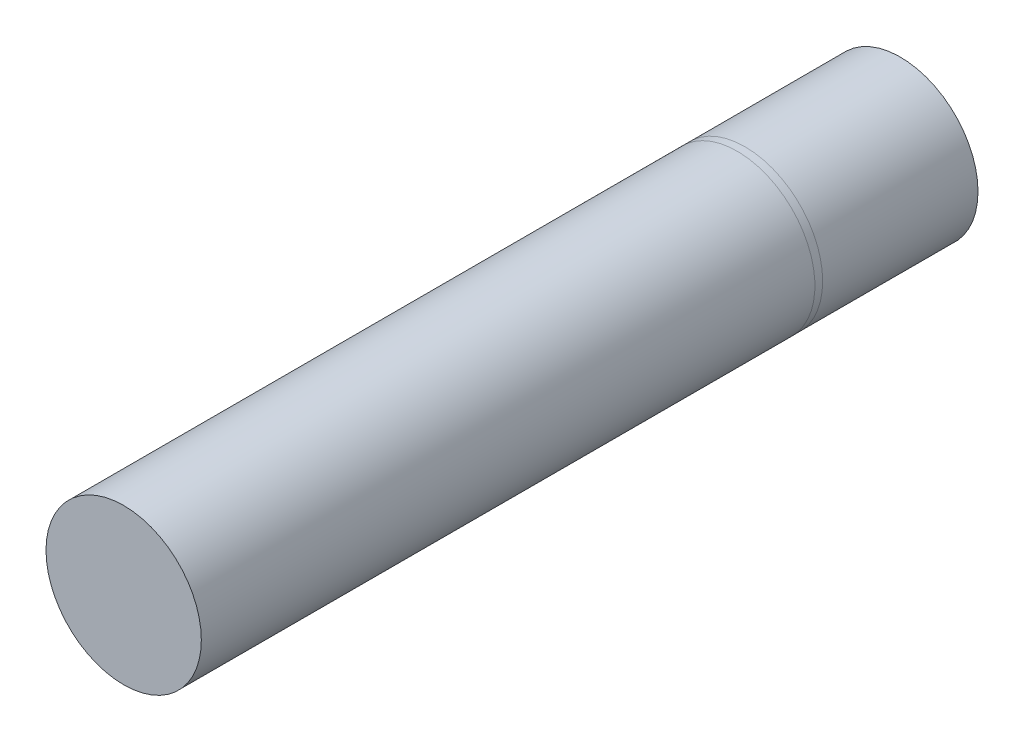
ISO-10303-21;
HEADER;
FILE_DESCRIPTION(('STEP AP214'),'2;1');
FILE_NAME('part.step','',(''),(''),'','','');
FILE_SCHEMA(('AUTOMOTIVE_DESIGN { 1 0 10303 214 1 1 1 1 }'));
ENDSEC;
DATA;
#1=APPLICATION_CONTEXT('core data for automotive mechanical design processes');
#2=APPLICATION_PROTOCOL_DEFINITION('international standard','automotive_design',2000,#1);
#3=PRODUCT_CONTEXT('',#1,'mechanical');
#4=PRODUCT('Part','Part','',(#3));
#5=PRODUCT_RELATED_PRODUCT_CATEGORY('part','',(#4));
#6=PRODUCT_DEFINITION_FORMATION('','',#4);
#7=PRODUCT_DEFINITION_CONTEXT('part definition',#1,'design');
#8=PRODUCT_DEFINITION('design','',#6,#7);
#9=PRODUCT_DEFINITION_SHAPE('','',#8);
#10=(LENGTH_UNIT() NAMED_UNIT(*) SI_UNIT(.MILLI.,.METRE.));
#11=(NAMED_UNIT(*) PLANE_ANGLE_UNIT() SI_UNIT($,.RADIAN.));
#12=(NAMED_UNIT(*) SI_UNIT($,.STERADIAN.) SOLID_ANGLE_UNIT());
#13=UNCERTAINTY_MEASURE_WITH_UNIT(LENGTH_MEASURE(1.E-05),#10,'distance_accuracy_value','');
#14=(GEOMETRIC_REPRESENTATION_CONTEXT(3) GLOBAL_UNCERTAINTY_ASSIGNED_CONTEXT((#13)) GLOBAL_UNIT_ASSIGNED_CONTEXT((#10,
#11,#12)) REPRESENTATION_CONTEXT('',''));
#15=CARTESIAN_POINT('',(0.,0.,0.));
#16=DIRECTION('',(0.,0.,1.));
#17=DIRECTION('',(1.,0.,0.));
#18=AXIS2_PLACEMENT_3D('',#15,#16,#17);
#19=CARTESIAN_POINT('',(0.,0.,100.));
#20=DIRECTION('',(0.,0.,-1.));
#21=DIRECTION('',(-1.,0.,0.));
#22=AXIS2_PLACEMENT_3D('',#19,#20,#21);
#23=CYLINDRICAL_SURFACE('',#22,10.);
#24=CARTESIAN_POINT('',(0.,0.,100.));
#25=DIRECTION('',(0.,0.,1.));
#26=DIRECTION('',(1.,0.,0.));
#27=AXIS2_PLACEMENT_3D('',#24,#25,#26);
#28=CIRCLE('',#27,10.);
#29=CARTESIAN_POINT('',(10.,0.,100.));
#30=VERTEX_POINT('',#29);
#31=EDGE_CURVE('E49',#30,#30,#28,.T.);
#32=ORIENTED_EDGE('',*,*,#31,.F.);
#33=EDGE_LOOP('',(#32));
#34=FACE_BOUND('',#33,.T.);
#35=CARTESIAN_POINT('',(0.,0.,21.));
#36=DIRECTION('',(0.,0.,-1.));
#37=DIRECTION('',(-1.,0.,0.));
#38=AXIS2_PLACEMENT_3D('',#35,#36,#37);
#39=CIRCLE('',#38,10.);
#40=CARTESIAN_POINT('',(-10.,0.,21.));
#41=VERTEX_POINT('',#40);
#42=EDGE_CURVE('E10',#41,#41,#39,.T.);
#43=ORIENTED_EDGE('',*,*,#42,.F.);
#44=EDGE_LOOP('',(#43));
#45=FACE_BOUND('',#44,.T.);
#46=ADVANCED_FACE('F34',(#34,#45),#23,.T.);
#47=CARTESIAN_POINT('',(0.,0.,0.));
#48=DIRECTION('',(0.,0.,1.));
#49=DIRECTION('',(1.,0.,0.));
#50=AXIS2_PLACEMENT_3D('',#47,#48,#49);
#51=CIRCLE('',#50,10.);
#52=CARTESIAN_POINT('',(10.,0.,0.));
#53=VERTEX_POINT('',#52);
#54=EDGE_CURVE('E55',#53,#53,#51,.T.);
#55=ORIENTED_EDGE('',*,*,#54,.T.);
#56=EDGE_LOOP('',(#55));
#57=FACE_BOUND('',#56,.T.);
#58=CARTESIAN_POINT('',(0.,0.,20.));
#59=DIRECTION('',(0.,0.,1.));
#60=DIRECTION('',(1.,0.,0.));
#61=AXIS2_PLACEMENT_3D('',#58,#59,#60);
#62=CIRCLE('',#61,10.);
#63=CARTESIAN_POINT('',(10.,0.,20.));
#64=VERTEX_POINT('',#63);
#65=EDGE_CURVE('E42',#64,#64,#62,.T.);
#66=ORIENTED_EDGE('',*,*,#65,.F.);
#67=EDGE_LOOP('',(#66));
#68=FACE_BOUND('',#67,.T.);
#69=ADVANCED_FACE('F61',(#57,#68),#23,.T.);
#70=ORIENTED_EDGE('',*,*,#42,.T.);
#71=EDGE_LOOP('',(#70));
#72=FACE_BOUND('',#71,.T.);
#73=ORIENTED_EDGE('',*,*,#65,.T.);
#74=EDGE_LOOP('',(#73));
#75=FACE_BOUND('',#74,.T.);
#76=ADVANCED_FACE('F36',(#72,#75),#23,.T.);
#77=CARTESIAN_POINT('',(0.,0.,100.));
#78=DIRECTION('',(0.,0.,1.));
#79=DIRECTION('',(1.,0.,0.));
#80=AXIS2_PLACEMENT_3D('',#77,#78,#79);
#81=PLANE('',#80);
#82=ORIENTED_EDGE('',*,*,#31,.T.);
#83=EDGE_LOOP('',(#82));
#84=FACE_BOUND('',#83,.T.);
#85=ADVANCED_FACE('F66',(#84),#81,.T.);
#86=CARTESIAN_POINT('',(0.,0.,0.));
#87=DIRECTION('',(0.,0.,1.));
#88=DIRECTION('',(1.,0.,0.));
#89=AXIS2_PLACEMENT_3D('',#86,#87,#88);
#90=PLANE('',#89);
#91=ORIENTED_EDGE('',*,*,#54,.F.);
#92=EDGE_LOOP('',(#91));
#93=FACE_BOUND('',#92,.T.);
#94=ADVANCED_FACE('F64',(#93),#90,.F.);
#95=CLOSED_SHELL('',(#46,#69,#76,#85,#94));
#96=MANIFOLD_SOLID_BREP('B2',#95);
#97=ADVANCED_BREP_SHAPE_REPRESENTATION('',(#18,#96),#14);
#98=SHAPE_DEFINITION_REPRESENTATION(#9,#97);
ENDSEC;
END-ISO-10303-21;
